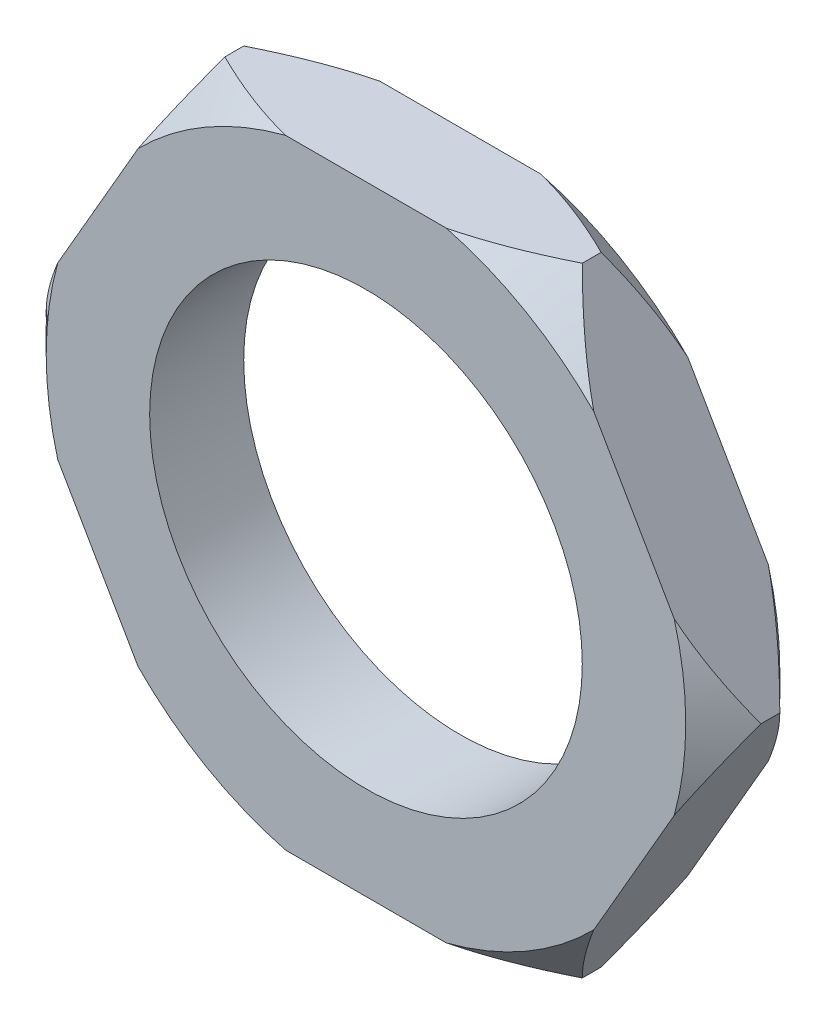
from build123d import *

# Parameters (mm, degrees)
ESQUISSE1_R             = 9.5
ESQUISSE1_R_2           = 5.75
BOSS_EXTRU_1_DEPTH      = 2.5
CHANFREIN1_SIZE         = 1
ESQUISSE3_OUTSIDE_W     = 26.398
ESQUISSE3_OUTSIDE_H     = 26.398
ENL_V_MAT_EXTRU_1_DEPTH = 2.5


with BuildPart() as part:
    # Esquisse1 → Boss.-Extru.1 (new body)
    with BuildSketch(Plane.XY):
        Circle(ESQUISSE1_R)
        Circle(ESQUISSE1_R_2, mode=Mode.SUBTRACT)
    extrude(amount=BOSS_EXTRU_1_DEPTH)

    # Chanfrein1
    chanfrein1_edges = [part.edges().sort_by_distance(p)[0] for p in [
        (-9.5, 0, 0),
        (-9.5, 0, 2.5),
    ]]
    chamfer(chanfrein1_edges, length=CHANFREIN1_SIZE)

    # Esquisse3 outside → Enl_v. mat.-Extru.1 (cut)
    with BuildSketch(Plane.XY.offset(2.5)):
        Rectangle(ESQUISSE3_OUTSIDE_W, ESQUISSE3_OUTSIDE_H)
        Polygon((-9.5, 0), (-4.75, -8.227241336), (4.75, -8.227241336), (9.5, 0), (4.75, 8.227241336), (-4.75, 8.227241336), align=None, mode=Mode.SUBTRACT)
    extrude(amount=-ENL_V_MAT_EXTRU_1_DEPTH, mode=Mode.SUBTRACT)


solid = part.part
